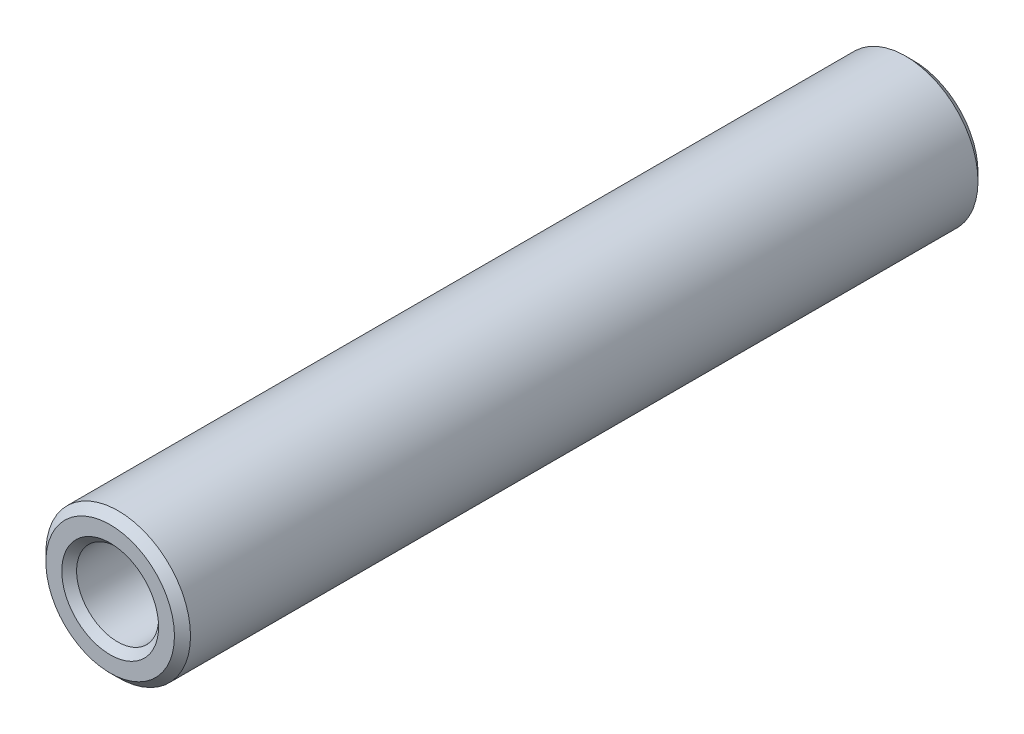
ISO-10303-21;
HEADER;
FILE_DESCRIPTION(('STEP AP214'),'2;1');
FILE_NAME('part.step','',(''),(''),'','','');
FILE_SCHEMA(('AUTOMOTIVE_DESIGN { 1 0 10303 214 1 1 1 1 }'));
ENDSEC;
DATA;
#1=APPLICATION_CONTEXT('core data for automotive mechanical design processes');
#2=APPLICATION_PROTOCOL_DEFINITION('international standard','automotive_design',2000,#1);
#3=PRODUCT_CONTEXT('',#1,'mechanical');
#4=PRODUCT('Part','Part','',(#3));
#5=PRODUCT_RELATED_PRODUCT_CATEGORY('part','',(#4));
#6=PRODUCT_DEFINITION_FORMATION('','',#4);
#7=PRODUCT_DEFINITION_CONTEXT('part definition',#1,'design');
#8=PRODUCT_DEFINITION('design','',#6,#7);
#9=PRODUCT_DEFINITION_SHAPE('','',#8);
#10=(LENGTH_UNIT() NAMED_UNIT(*) SI_UNIT(.MILLI.,.METRE.));
#11=(NAMED_UNIT(*) PLANE_ANGLE_UNIT() SI_UNIT($,.RADIAN.));
#12=(NAMED_UNIT(*) SI_UNIT($,.STERADIAN.) SOLID_ANGLE_UNIT());
#13=UNCERTAINTY_MEASURE_WITH_UNIT(LENGTH_MEASURE(1.E-05),#10,'distance_accuracy_value','');
#14=(GEOMETRIC_REPRESENTATION_CONTEXT(3) GLOBAL_UNCERTAINTY_ASSIGNED_CONTEXT((#13)) GLOBAL_UNIT_ASSIGNED_CONTEXT((#10,
#11,#12)) REPRESENTATION_CONTEXT('',''));
#15=CARTESIAN_POINT('',(0.,0.,0.));
#16=DIRECTION('',(0.,0.,1.));
#17=DIRECTION('',(1.,0.,0.));
#18=AXIS2_PLACEMENT_3D('',#15,#16,#17);
#19=CARTESIAN_POINT('',(0.,0.,100.));
#20=DIRECTION('',(0.,0.,-1.));
#21=DIRECTION('',(-1.,0.,0.));
#22=AXIS2_PLACEMENT_3D('',#19,#20,#21);
#23=CYLINDRICAL_SURFACE('',#22,9.);
#24=CARTESIAN_POINT('',(0.,0.,0.999999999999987));
#25=DIRECTION('',(0.,0.,1.));
#26=DIRECTION('',(1.,0.,0.));
#27=AXIS2_PLACEMENT_3D('',#24,#25,#26);
#28=CIRCLE('',#27,9.);
#29=CARTESIAN_POINT('',(9.,0.,0.999999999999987));
#30=VERTEX_POINT('',#29);
#31=EDGE_CURVE('E59',#30,#30,#28,.T.);
#32=ORIENTED_EDGE('',*,*,#31,.T.);
#33=EDGE_LOOP('',(#32));
#34=FACE_BOUND('',#33,.T.);
#35=CARTESIAN_POINT('',(0.,0.,99.));
#36=DIRECTION('',(0.,0.,1.));
#37=DIRECTION('',(1.,0.,0.));
#38=AXIS2_PLACEMENT_3D('',#35,#36,#37);
#39=CIRCLE('',#38,9.);
#40=CARTESIAN_POINT('',(9.,0.,99.));
#41=VERTEX_POINT('',#40);
#42=EDGE_CURVE('E55',#41,#41,#39,.F.);
#43=ORIENTED_EDGE('',*,*,#42,.T.);
#44=EDGE_LOOP('',(#43));
#45=FACE_BOUND('',#44,.T.);
#46=ADVANCED_FACE('F36',(#34,#45),#23,.T.);
#47=CARTESIAN_POINT('',(0.,0.,100.));
#48=DIRECTION('',(0.,0.,1.));
#49=DIRECTION('',(1.,0.,0.));
#50=AXIS2_PLACEMENT_3D('',#47,#48,#49);
#51=PLANE('',#50);
#52=CARTESIAN_POINT('',(0.,0.,100.));
#53=DIRECTION('',(0.,0.,1.));
#54=DIRECTION('',(1.,0.,0.));
#55=AXIS2_PLACEMENT_3D('',#52,#53,#54);
#56=CIRCLE('',#55,6.025);
#57=CARTESIAN_POINT('',(6.025,0.,100.));
#58=VERTEX_POINT('',#57);
#59=EDGE_CURVE('E62',#58,#58,#56,.T.);
#60=ORIENTED_EDGE('',*,*,#59,.F.);
#61=EDGE_LOOP('',(#60));
#62=FACE_BOUND('',#61,.T.);
#63=CARTESIAN_POINT('',(0.,0.,100.));
#64=DIRECTION('',(0.,0.,1.));
#65=DIRECTION('',(1.,0.,0.));
#66=AXIS2_PLACEMENT_3D('',#63,#64,#65);
#67=CIRCLE('',#66,8.00000000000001);
#68=CARTESIAN_POINT('',(8.00000000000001,0.,100.));
#69=VERTEX_POINT('',#68);
#70=EDGE_CURVE('E11',#69,#69,#67,.T.);
#71=ORIENTED_EDGE('',*,*,#70,.T.);
#72=EDGE_LOOP('',(#71));
#73=FACE_BOUND('',#72,.T.);
#74=ADVANCED_FACE('F79',(#62,#73),#51,.T.);
#75=CARTESIAN_POINT('',(0.,0.,0.));
#76=DIRECTION('',(0.,0.,1.));
#77=DIRECTION('',(1.,0.,0.));
#78=AXIS2_PLACEMENT_3D('',#75,#76,#77);
#79=PLANE('',#78);
#80=CARTESIAN_POINT('',(0.,0.,0.));
#81=DIRECTION('',(0.,0.,1.));
#82=DIRECTION('',(1.,0.,0.));
#83=AXIS2_PLACEMENT_3D('',#80,#81,#82);
#84=CIRCLE('',#83,8.00000000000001);
#85=CARTESIAN_POINT('',(8.00000000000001,0.,0.));
#86=VERTEX_POINT('',#85);
#87=EDGE_CURVE('E43',#86,#86,#84,.F.);
#88=ORIENTED_EDGE('',*,*,#87,.T.);
#89=EDGE_LOOP('',(#88));
#90=FACE_BOUND('',#89,.T.);
#91=ADVANCED_FACE('F70',(#90),#79,.F.);
#92=CARTESIAN_POINT('',(0.,0.,0.999999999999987));
#93=DIRECTION('',(0.,0.,1.));
#94=DIRECTION('',(1.,0.,0.));
#95=AXIS2_PLACEMENT_3D('',#92,#93,#94);
#96=CONICAL_SURFACE('',#95,9.,0.785398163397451);
#97=ORIENTED_EDGE('',*,*,#87,.F.);
#98=EDGE_LOOP('',(#97));
#99=FACE_BOUND('',#98,.T.);
#100=ORIENTED_EDGE('',*,*,#31,.F.);
#101=EDGE_LOOP('',(#100));
#102=FACE_BOUND('',#101,.T.);
#103=ADVANCED_FACE('F72',(#99,#102),#96,.T.);
#104=CARTESIAN_POINT('',(0.,0.,100.));
#105=DIRECTION('',(0.,0.,-1.));
#106=DIRECTION('',(-1.,0.,0.));
#107=AXIS2_PLACEMENT_3D('',#104,#105,#106);
#108=CONICAL_SURFACE('',#107,8.00000000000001,0.785398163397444);
#109=ORIENTED_EDGE('',*,*,#42,.F.);
#110=EDGE_LOOP('',(#109));
#111=FACE_BOUND('',#110,.T.);
#112=ORIENTED_EDGE('',*,*,#70,.F.);
#113=EDGE_LOOP('',(#112));
#114=FACE_BOUND('',#113,.T.);
#115=ADVANCED_FACE('F38',(#111,#114),#108,.T.);
#116=CARTESIAN_POINT('',(0.,0.,71.25));
#117=DIRECTION('',(0.,0.,1.));
#118=DIRECTION('',(1.,0.,0.));
#119=AXIS2_PLACEMENT_3D('',#116,#117,#118);
#120=CONICAL_SURFACE('',#119,5.09999999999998,1.02974425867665);
#121=CARTESIAN_POINT('',(0.,0.,68.1856108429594));
#122=VERTEX_POINT('',#121);
#123=VERTEX_LOOP('',#122);
#124=FACE_BOUND('',#123,.T.);
#125=CARTESIAN_POINT('',(0.,0.,71.25));
#126=DIRECTION('',(0.,0.,1.));
#127=DIRECTION('',(1.,0.,0.));
#128=AXIS2_PLACEMENT_3D('',#125,#126,#127);
#129=CIRCLE('',#128,5.09999999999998);
#130=CARTESIAN_POINT('',(5.09999999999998,0.,71.25));
#131=VERTEX_POINT('',#130);
#132=EDGE_CURVE('E53',#131,#131,#129,.T.);
#133=ORIENTED_EDGE('',*,*,#132,.T.);
#134=EDGE_LOOP('',(#133));
#135=FACE_BOUND('',#134,.T.);
#136=ADVANCED_FACE('F46',(#124,#135),#120,.F.);
#137=CARTESIAN_POINT('',(0.,0.,100.));
#138=DIRECTION('',(0.,0.,1.));
#139=DIRECTION('',(1.,0.,0.));
#140=AXIS2_PLACEMENT_3D('',#137,#138,#139);
#141=CYLINDRICAL_SURFACE('',#140,5.09999999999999);
#142=ORIENTED_EDGE('',*,*,#132,.F.);
#143=EDGE_LOOP('',(#142));
#144=FACE_BOUND('',#143,.T.);
#145=CARTESIAN_POINT('',(0.,0.,99.075));
#146=DIRECTION('',(0.,0.,1.));
#147=DIRECTION('',(1.,0.,0.));
#148=AXIS2_PLACEMENT_3D('',#145,#146,#147);
#149=CIRCLE('',#148,5.1);
#150=CARTESIAN_POINT('',(5.1,0.,99.075));
#151=VERTEX_POINT('',#150);
#152=EDGE_CURVE('E56',#151,#151,#149,.T.);
#153=ORIENTED_EDGE('',*,*,#152,.T.);
#154=EDGE_LOOP('',(#153));
#155=FACE_BOUND('',#154,.T.);
#156=ADVANCED_FACE('F49',(#144,#155),#141,.F.);
#157=CARTESIAN_POINT('',(0.,0.,100.));
#158=DIRECTION('',(0.,0.,1.));
#159=DIRECTION('',(1.,0.,0.));
#160=AXIS2_PLACEMENT_3D('',#157,#158,#159);
#161=CONICAL_SURFACE('',#160,6.025,0.785398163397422);
#162=ORIENTED_EDGE('',*,*,#152,.F.);
#163=EDGE_LOOP('',(#162));
#164=FACE_BOUND('',#163,.T.);
#165=ORIENTED_EDGE('',*,*,#59,.T.);
#166=EDGE_LOOP('',(#165));
#167=FACE_BOUND('',#166,.T.);
#168=ADVANCED_FACE('F98',(#164,#167),#161,.F.);
#169=CLOSED_SHELL('',(#46,#74,#91,#103,#115,#136,#156,#168));
#170=MANIFOLD_SOLID_BREP('B2',#169);
#171=ADVANCED_BREP_SHAPE_REPRESENTATION('',(#18,#170),#14);
#172=SHAPE_DEFINITION_REPRESENTATION(#9,#171);
ENDSEC;
END-ISO-10303-21;
